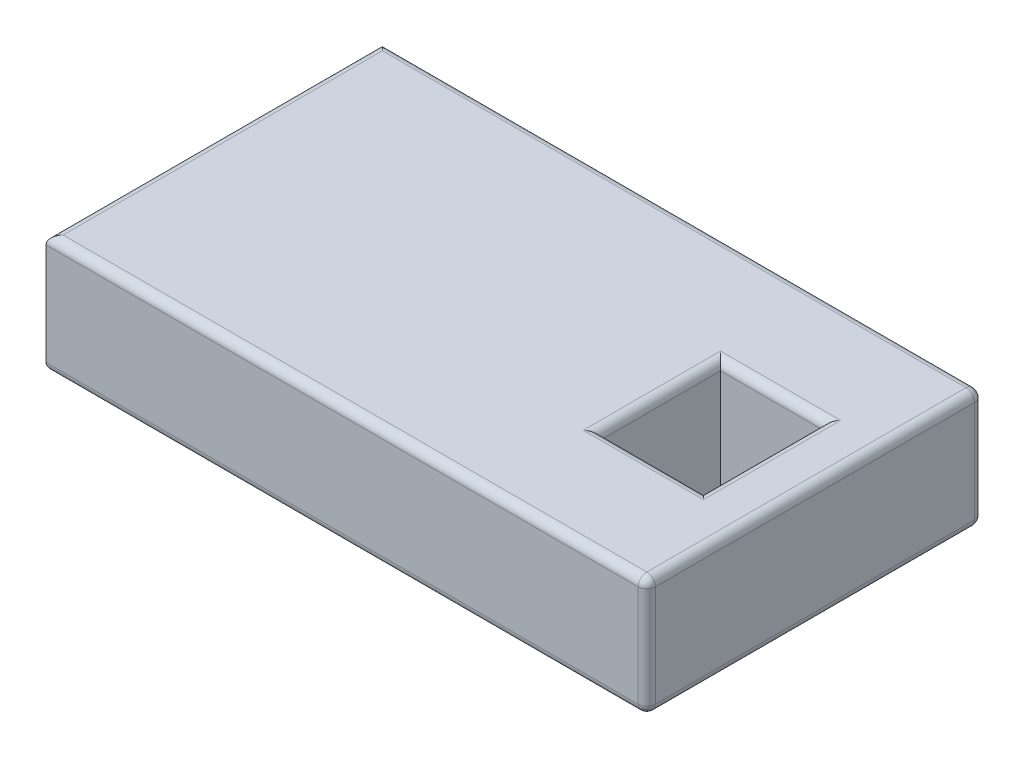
ISO-10303-21;
HEADER;
FILE_DESCRIPTION(('STEP AP214'),'2;1');
FILE_NAME('part.step','',(''),(''),'','','');
FILE_SCHEMA(('AUTOMOTIVE_DESIGN { 1 0 10303 214 1 1 1 1 }'));
ENDSEC;
DATA;
#1=APPLICATION_CONTEXT('core data for automotive mechanical design processes');
#2=APPLICATION_PROTOCOL_DEFINITION('international standard','automotive_design',2000,#1);
#3=PRODUCT_CONTEXT('',#1,'mechanical');
#4=PRODUCT('Part','Part','',(#3));
#5=PRODUCT_RELATED_PRODUCT_CATEGORY('part','',(#4));
#6=PRODUCT_DEFINITION_FORMATION('','',#4);
#7=PRODUCT_DEFINITION_CONTEXT('part definition',#1,'design');
#8=PRODUCT_DEFINITION('design','',#6,#7);
#9=PRODUCT_DEFINITION_SHAPE('','',#8);
#10=(LENGTH_UNIT() NAMED_UNIT(*) SI_UNIT(.MILLI.,.METRE.));
#11=(NAMED_UNIT(*) PLANE_ANGLE_UNIT() SI_UNIT($,.RADIAN.));
#12=(NAMED_UNIT(*) SI_UNIT($,.STERADIAN.) SOLID_ANGLE_UNIT());
#13=UNCERTAINTY_MEASURE_WITH_UNIT(LENGTH_MEASURE(1.E-05),#10,'distance_accuracy_value','');
#14=(GEOMETRIC_REPRESENTATION_CONTEXT(3) GLOBAL_UNCERTAINTY_ASSIGNED_CONTEXT((#13)) GLOBAL_UNIT_ASSIGNED_CONTEXT((#10,
#11,#12)) REPRESENTATION_CONTEXT('',''));
#15=CARTESIAN_POINT('',(0.,0.,0.));
#16=DIRECTION('',(0.,0.,1.));
#17=DIRECTION('',(1.,0.,0.));
#18=AXIS2_PLACEMENT_3D('',#15,#16,#17);
#19=CARTESIAN_POINT('',(35.,3.46,-9.795));
#20=DIRECTION('',(0.,0.,1.));
#21=DIRECTION('',(1.,0.,0.));
#22=AXIS2_PLACEMENT_3D('',#19,#20,#21);
#23=PLANE('',#22);
#24=DIRECTION('',(0.,1.,0.));
#25=VECTOR('',#24,1.);
#26=CARTESIAN_POINT('',(34.5,-3.46,-9.795));
#27=LINE('',#26,#25);
#28=CARTESIAN_POINT('',(34.5,2.96,-9.795));
#29=VERTEX_POINT('',#28);
#30=CARTESIAN_POINT('',(34.5,-2.96,-9.795));
#31=VERTEX_POINT('',#30);
#32=EDGE_CURVE('E221',#29,#31,#27,.F.);
#33=ORIENTED_EDGE('',*,*,#32,.T.);
#34=DIRECTION('',(-1.,0.,0.));
#35=VECTOR('',#34,1.);
#36=CARTESIAN_POINT('',(35.,-2.96,-9.795));
#37=LINE('',#36,#35);
#38=CARTESIAN_POINT('',(0.,-2.96,-9.795));
#39=VERTEX_POINT('',#38);
#40=EDGE_CURVE('E176',#31,#39,#37,.T.);
#41=ORIENTED_EDGE('',*,*,#40,.T.);
#42=DIRECTION('',(0.,1.,0.));
#43=VECTOR('',#42,1.);
#44=CARTESIAN_POINT('',(0.,3.46,-9.795));
#45=LINE('',#44,#43);
#46=CARTESIAN_POINT('',(0.,2.96,-9.795));
#47=VERTEX_POINT('',#46);
#48=EDGE_CURVE('E197',#39,#47,#45,.T.);
#49=ORIENTED_EDGE('',*,*,#48,.T.);
#50=DIRECTION('',(-1.,0.,0.));
#51=VECTOR('',#50,1.);
#52=CARTESIAN_POINT('',(35.,2.96,-9.795));
#53=LINE('',#52,#51);
#54=EDGE_CURVE('E219',#47,#29,#53,.F.);
#55=ORIENTED_EDGE('',*,*,#54,.T.);
#56=EDGE_LOOP('',(#33,#41,#49,#55));
#57=FACE_BOUND('',#56,.T.);
#58=ADVANCED_FACE('F34',(#57),#23,.F.);
#59=CARTESIAN_POINT('',(35.,3.46,9.795));
#60=DIRECTION('',(0.,-1.,0.));
#61=DIRECTION('',(0.,0.,-1.));
#62=AXIS2_PLACEMENT_3D('',#59,#60,#61);
#63=PLANE('',#62);
#64=DIRECTION('',(0.,0.,1.));
#65=VECTOR('',#64,1.);
#66=CARTESIAN_POINT('',(34.5,3.46,-9.795));
#67=LINE('',#66,#65);
#68=CARTESIAN_POINT('',(34.5,3.46,9.295));
#69=VERTEX_POINT('',#68);
#70=CARTESIAN_POINT('',(34.5,3.46,-9.295));
#71=VERTEX_POINT('',#70);
#72=EDGE_CURVE('E43',#69,#71,#67,.F.);
#73=ORIENTED_EDGE('',*,*,#72,.T.);
#74=DIRECTION('',(-1.,0.,0.));
#75=VECTOR('',#74,1.);
#76=CARTESIAN_POINT('',(35.,3.46,-9.295));
#77=LINE('',#76,#75);
#78=CARTESIAN_POINT('',(0.5,3.46,-9.295));
#79=VERTEX_POINT('',#78);
#80=EDGE_CURVE('E11',#71,#79,#77,.T.);
#81=ORIENTED_EDGE('',*,*,#80,.T.);
#82=DIRECTION('',(0.,0.,1.));
#83=VECTOR('',#82,1.);
#84=CARTESIAN_POINT('',(0.5,3.46,9.795));
#85=LINE('',#84,#83);
#86=CARTESIAN_POINT('',(0.5,3.46,9.295));
#87=VERTEX_POINT('',#86);
#88=EDGE_CURVE('E264',#79,#87,#85,.T.);
#89=ORIENTED_EDGE('',*,*,#88,.T.);
#90=DIRECTION('',(-1.,0.,0.));
#91=VECTOR('',#90,1.);
#92=CARTESIAN_POINT('',(35.,3.46,9.295));
#93=LINE('',#92,#91);
#94=EDGE_CURVE('E54',#87,#69,#93,.F.);
#95=ORIENTED_EDGE('',*,*,#94,.T.);
#96=EDGE_LOOP('',(#73,#81,#89,#95));
#97=FACE_BOUND('',#96,.T.);
#98=DIRECTION('',(-1.,0.,0.));
#99=VECTOR('',#98,1.);
#100=CARTESIAN_POINT('',(35.,3.46,-4.));
#101=LINE('',#100,#99);
#102=CARTESIAN_POINT('',(25.5,3.46,-4.));
#103=VERTEX_POINT('',#102);
#104=CARTESIAN_POINT('',(32.5,3.46,-4.));
#105=VERTEX_POINT('',#104);
#106=EDGE_CURVE('E259',#103,#105,#101,.F.);
#107=ORIENTED_EDGE('',*,*,#106,.T.);
#108=DIRECTION('',(0.,0.,-1.));
#109=VECTOR('',#108,1.);
#110=CARTESIAN_POINT('',(32.5,3.46,9.795));
#111=LINE('',#110,#109);
#112=CARTESIAN_POINT('',(32.5,3.46,4.));
#113=VERTEX_POINT('',#112);
#114=EDGE_CURVE('E261',#105,#113,#111,.F.);
#115=ORIENTED_EDGE('',*,*,#114,.T.);
#116=DIRECTION('',(1.,0.,0.));
#117=VECTOR('',#116,1.);
#118=CARTESIAN_POINT('',(35.,3.46,4.));
#119=LINE('',#118,#117);
#120=CARTESIAN_POINT('',(25.5,3.46,4.));
#121=VERTEX_POINT('',#120);
#122=EDGE_CURVE('E255',#113,#121,#119,.F.);
#123=ORIENTED_EDGE('',*,*,#122,.T.);
#124=DIRECTION('',(0.,0.,1.));
#125=VECTOR('',#124,1.);
#126=CARTESIAN_POINT('',(25.5,3.46,9.795));
#127=LINE('',#126,#125);
#128=EDGE_CURVE('E257',#121,#103,#127,.F.);
#129=ORIENTED_EDGE('',*,*,#128,.T.);
#130=EDGE_LOOP('',(#107,#115,#123,#129));
#131=FACE_BOUND('',#130,.T.);
#132=ADVANCED_FACE('F332',(#97,#131),#63,.F.);
#133=CARTESIAN_POINT('',(35.,3.46,9.795));
#134=DIRECTION('',(0.,0.,-1.));
#135=DIRECTION('',(0.,1.,0.));
#136=AXIS2_PLACEMENT_3D('',#133,#134,#135);
#137=PLANE('',#136);
#138=DIRECTION('',(0.,-1.,0.));
#139=VECTOR('',#138,1.);
#140=CARTESIAN_POINT('',(0.,3.46,9.795));
#141=LINE('',#140,#139);
#142=CARTESIAN_POINT('',(0.,2.96,9.795));
#143=VERTEX_POINT('',#142);
#144=CARTESIAN_POINT('',(0.,-2.96,9.795));
#145=VERTEX_POINT('',#144);
#146=EDGE_CURVE('E194',#143,#145,#141,.T.);
#147=ORIENTED_EDGE('',*,*,#146,.T.);
#148=DIRECTION('',(-1.,0.,0.));
#149=VECTOR('',#148,1.);
#150=CARTESIAN_POINT('',(35.,-2.96,9.795));
#151=LINE('',#150,#149);
#152=CARTESIAN_POINT('',(34.5,-2.96,9.795));
#153=VERTEX_POINT('',#152);
#154=EDGE_CURVE('E216',#145,#153,#151,.F.);
#155=ORIENTED_EDGE('',*,*,#154,.T.);
#156=DIRECTION('',(0.,-1.,0.));
#157=VECTOR('',#156,1.);
#158=CARTESIAN_POINT('',(34.5,3.46,9.795));
#159=LINE('',#158,#157);
#160=CARTESIAN_POINT('',(34.5,2.96,9.795));
#161=VERTEX_POINT('',#160);
#162=EDGE_CURVE('E214',#153,#161,#159,.F.);
#163=ORIENTED_EDGE('',*,*,#162,.T.);
#164=DIRECTION('',(-1.,0.,0.));
#165=VECTOR('',#164,1.);
#166=CARTESIAN_POINT('',(35.,2.96,9.795));
#167=LINE('',#166,#165);
#168=EDGE_CURVE('E212',#161,#143,#167,.T.);
#169=ORIENTED_EDGE('',*,*,#168,.T.);
#170=EDGE_LOOP('',(#147,#155,#163,#169));
#171=FACE_BOUND('',#170,.T.);
#172=ADVANCED_FACE('F408',(#171),#137,.F.);
#173=CARTESIAN_POINT('',(35.,-3.46,9.795));
#174=DIRECTION('',(0.,1.,0.));
#175=DIRECTION('',(0.,0.,1.));
#176=AXIS2_PLACEMENT_3D('',#173,#174,#175);
#177=PLANE('',#176);
#178=DIRECTION('',(1.,0.,0.));
#179=VECTOR('',#178,1.);
#180=CARTESIAN_POINT('',(35.,-3.46,4.));
#181=LINE('',#180,#179);
#182=CARTESIAN_POINT('',(25.5,-3.46,4.));
#183=VERTEX_POINT('',#182);
#184=CARTESIAN_POINT('',(32.5,-3.46,4.));
#185=VERTEX_POINT('',#184);
#186=EDGE_CURVE('E207',#183,#185,#181,.T.);
#187=ORIENTED_EDGE('',*,*,#186,.T.);
#188=DIRECTION('',(0.,0.,-1.));
#189=VECTOR('',#188,1.);
#190=CARTESIAN_POINT('',(32.5,-3.46,9.795));
#191=LINE('',#190,#189);
#192=CARTESIAN_POINT('',(32.5,-3.46,-4.));
#193=VERTEX_POINT('',#192);
#194=EDGE_CURVE('E209',#185,#193,#191,.T.);
#195=ORIENTED_EDGE('',*,*,#194,.T.);
#196=DIRECTION('',(-1.,0.,0.));
#197=VECTOR('',#196,1.);
#198=CARTESIAN_POINT('',(35.,-3.46,-4.));
#199=LINE('',#198,#197);
#200=CARTESIAN_POINT('',(25.5,-3.46,-4.));
#201=VERTEX_POINT('',#200);
#202=EDGE_CURVE('E203',#193,#201,#199,.T.);
#203=ORIENTED_EDGE('',*,*,#202,.T.);
#204=DIRECTION('',(0.,0.,1.));
#205=VECTOR('',#204,1.);
#206=CARTESIAN_POINT('',(25.5,-3.46,9.795));
#207=LINE('',#206,#205);
#208=EDGE_CURVE('E205',#201,#183,#207,.T.);
#209=ORIENTED_EDGE('',*,*,#208,.T.);
#210=EDGE_LOOP('',(#187,#195,#203,#209));
#211=FACE_BOUND('',#210,.T.);
#212=DIRECTION('',(-1.,0.,0.));
#213=VECTOR('',#212,1.);
#214=CARTESIAN_POINT('',(35.,-3.46,9.295));
#215=LINE('',#214,#213);
#216=CARTESIAN_POINT('',(34.5,-3.46,9.295));
#217=VERTEX_POINT('',#216);
#218=CARTESIAN_POINT('',(0.5,-3.46,9.295));
#219=VERTEX_POINT('',#218);
#220=EDGE_CURVE('E169',#217,#219,#215,.T.);
#221=ORIENTED_EDGE('',*,*,#220,.T.);
#222=DIRECTION('',(0.,0.,-1.));
#223=VECTOR('',#222,1.);
#224=CARTESIAN_POINT('',(0.5,-3.46,9.795));
#225=LINE('',#224,#223);
#226=CARTESIAN_POINT('',(0.5,-3.46,-9.295));
#227=VERTEX_POINT('',#226);
#228=EDGE_CURVE('E165',#219,#227,#225,.T.);
#229=ORIENTED_EDGE('',*,*,#228,.T.);
#230=DIRECTION('',(-1.,0.,0.));
#231=VECTOR('',#230,1.);
#232=CARTESIAN_POINT('',(35.,-3.46,-9.295));
#233=LINE('',#232,#231);
#234=CARTESIAN_POINT('',(34.5,-3.46,-9.295));
#235=VERTEX_POINT('',#234);
#236=EDGE_CURVE('E157',#227,#235,#233,.F.);
#237=ORIENTED_EDGE('',*,*,#236,.T.);
#238=DIRECTION('',(0.,0.,-1.));
#239=VECTOR('',#238,1.);
#240=CARTESIAN_POINT('',(34.5,-3.46,9.795));
#241=LINE('',#240,#239);
#242=EDGE_CURVE('E162',#235,#217,#241,.F.);
#243=ORIENTED_EDGE('',*,*,#242,.T.);
#244=EDGE_LOOP('',(#221,#229,#237,#243));
#245=FACE_BOUND('',#244,.T.);
#246=ADVANCED_FACE('F160',(#211,#245),#177,.F.);
#247=CARTESIAN_POINT('',(35.,0.,0.));
#248=DIRECTION('',(1.,0.,0.));
#249=DIRECTION('',(0.,0.,-1.));
#250=AXIS2_PLACEMENT_3D('',#247,#248,#249);
#251=PLANE('',#250);
#252=DIRECTION('',(0.,-1.,0.));
#253=VECTOR('',#252,1.);
#254=CARTESIAN_POINT('',(35.,-3.46,9.295));
#255=LINE('',#254,#253);
#256=CARTESIAN_POINT('',(35.,2.96,9.295));
#257=VERTEX_POINT('',#256);
#258=CARTESIAN_POINT('',(35.,-2.96,9.295));
#259=VERTEX_POINT('',#258);
#260=EDGE_CURVE('E250',#257,#259,#255,.T.);
#261=ORIENTED_EDGE('',*,*,#260,.T.);
#262=DIRECTION('',(0.,0.,-1.));
#263=VECTOR('',#262,1.);
#264=CARTESIAN_POINT('',(35.,-2.96,-9.795));
#265=LINE('',#264,#263);
#266=CARTESIAN_POINT('',(35.,-2.96,-9.295));
#267=VERTEX_POINT('',#266);
#268=EDGE_CURVE('E252',#259,#267,#265,.T.);
#269=ORIENTED_EDGE('',*,*,#268,.T.);
#270=DIRECTION('',(0.,1.,0.));
#271=VECTOR('',#270,1.);
#272=CARTESIAN_POINT('',(35.,3.46,-9.295));
#273=LINE('',#272,#271);
#274=CARTESIAN_POINT('',(35.,2.96,-9.295));
#275=VERTEX_POINT('',#274);
#276=EDGE_CURVE('E248',#267,#275,#273,.T.);
#277=ORIENTED_EDGE('',*,*,#276,.T.);
#278=DIRECTION('',(0.,0.,1.));
#279=VECTOR('',#278,1.);
#280=CARTESIAN_POINT('',(35.,2.96,9.795));
#281=LINE('',#280,#279);
#282=EDGE_CURVE('E246',#275,#257,#281,.T.);
#283=ORIENTED_EDGE('',*,*,#282,.T.);
#284=EDGE_LOOP('',(#261,#269,#277,#283));
#285=FACE_BOUND('',#284,.T.);
#286=ADVANCED_FACE('F387',(#285),#251,.T.);
#287=CARTESIAN_POINT('',(0.,0.,0.));
#288=DIRECTION('',(1.,0.,0.));
#289=DIRECTION('',(0.,0.,-1.));
#290=AXIS2_PLACEMENT_3D('',#287,#288,#289);
#291=PLANE('',#290);
#292=CARTESIAN_POINT('',(0.,0.,5.858));
#293=DIRECTION('',(-1.,0.,0.));
#294=DIRECTION('',(0.,0.,1.));
#295=AXIS2_PLACEMENT_3D('',#292,#293,#294);
#296=CIRCLE('',#295,2.16);
#297=CARTESIAN_POINT('',(0.,0.,8.018));
#298=VERTEX_POINT('',#297);
#299=EDGE_CURVE('E302',#298,#298,#296,.T.);
#300=ORIENTED_EDGE('',*,*,#299,.F.);
#301=EDGE_LOOP('',(#300));
#302=FACE_BOUND('',#301,.T.);
#303=CARTESIAN_POINT('',(0.,0.,-5.858));
#304=DIRECTION('',(-1.,0.,0.));
#305=DIRECTION('',(0.,0.,1.));
#306=AXIS2_PLACEMENT_3D('',#303,#304,#305);
#307=CIRCLE('',#306,2.16);
#308=CARTESIAN_POINT('',(0.,0.,-3.698));
#309=VERTEX_POINT('',#308);
#310=EDGE_CURVE('E729',#309,#309,#307,.T.);
#311=ORIENTED_EDGE('',*,*,#310,.F.);
#312=EDGE_LOOP('',(#311));
#313=FACE_BOUND('',#312,.T.);
#314=ORIENTED_EDGE('',*,*,#48,.F.);
#315=DIRECTION('',(0.,0.,-1.));
#316=VECTOR('',#315,1.);
#317=CARTESIAN_POINT('',(0.,-2.96,0.));
#318=LINE('',#317,#316);
#319=EDGE_CURVE('E226',#39,#145,#318,.F.);
#320=ORIENTED_EDGE('',*,*,#319,.T.);
#321=ORIENTED_EDGE('',*,*,#146,.F.);
#322=DIRECTION('',(0.,0.,1.));
#323=VECTOR('',#322,1.);
#324=CARTESIAN_POINT('',(0.,2.96,0.));
#325=LINE('',#324,#323);
#326=EDGE_CURVE('E224',#143,#47,#325,.F.);
#327=ORIENTED_EDGE('',*,*,#326,.T.);
#328=EDGE_LOOP('',(#314,#320,#321,#327));
#329=FACE_BOUND('',#328,.T.);
#330=ADVANCED_FACE('F654',(#302,#313,#329),#291,.F.);
#331=CARTESIAN_POINT('',(26.,-3.46,-3.5));
#332=DIRECTION('',(-1.,0.,0.));
#333=DIRECTION('',(0.,0.,1.));
#334=AXIS2_PLACEMENT_3D('',#331,#332,#333);
#335=PLANE('',#334);
#336=DIRECTION('',(0.,1.,0.));
#337=VECTOR('',#336,1.);
#338=CARTESIAN_POINT('',(26.,-3.46,3.5));
#339=LINE('',#338,#337);
#340=CARTESIAN_POINT('',(26.,-2.96,3.5));
#341=VERTEX_POINT('',#340);
#342=CARTESIAN_POINT('',(26.,2.96,3.5));
#343=VERTEX_POINT('',#342);
#344=EDGE_CURVE('E356',#341,#343,#339,.T.);
#345=ORIENTED_EDGE('',*,*,#344,.F.);
#346=DIRECTION('',(0.,0.,1.));
#347=VECTOR('',#346,1.);
#348=CARTESIAN_POINT('',(26.,-2.96,-3.5));
#349=LINE('',#348,#347);
#350=CARTESIAN_POINT('',(26.,-2.96,-3.5));
#351=VERTEX_POINT('',#350);
#352=EDGE_CURVE('E240',#341,#351,#349,.F.);
#353=ORIENTED_EDGE('',*,*,#352,.T.);
#354=DIRECTION('',(0.,1.,0.));
#355=VECTOR('',#354,1.);
#356=CARTESIAN_POINT('',(26.,-3.46,-3.5));
#357=LINE('',#356,#355);
#358=CARTESIAN_POINT('',(26.,2.96,-3.5));
#359=VERTEX_POINT('',#358);
#360=EDGE_CURVE('E353',#351,#359,#357,.T.);
#361=ORIENTED_EDGE('',*,*,#360,.T.);
#362=DIRECTION('',(0.,0.,1.));
#363=VECTOR('',#362,1.);
#364=CARTESIAN_POINT('',(26.,2.96,-3.5));
#365=LINE('',#364,#363);
#366=EDGE_CURVE('E238',#359,#343,#365,.T.);
#367=ORIENTED_EDGE('',*,*,#366,.T.);
#368=EDGE_LOOP('',(#345,#353,#361,#367));
#369=FACE_BOUND('',#368,.T.);
#370=ADVANCED_FACE('F646',(#369),#335,.F.);
#371=CARTESIAN_POINT('',(26.,-3.46,-3.5));
#372=DIRECTION('',(0.,0.,-1.));
#373=DIRECTION('',(-1.,0.,0.));
#374=AXIS2_PLACEMENT_3D('',#371,#372,#373);
#375=PLANE('',#374);
#376=ORIENTED_EDGE('',*,*,#360,.F.);
#377=DIRECTION('',(-1.,0.,0.));
#378=VECTOR('',#377,1.);
#379=CARTESIAN_POINT('',(26.,-2.96,-3.5));
#380=LINE('',#379,#378);
#381=CARTESIAN_POINT('',(32.,-2.96,-3.5));
#382=VERTEX_POINT('',#381);
#383=EDGE_CURVE('E244',#351,#382,#380,.F.);
#384=ORIENTED_EDGE('',*,*,#383,.T.);
#385=DIRECTION('',(0.,1.,0.));
#386=VECTOR('',#385,1.);
#387=CARTESIAN_POINT('',(32.,-3.46,-3.5));
#388=LINE('',#387,#386);
#389=CARTESIAN_POINT('',(32.,2.96,-3.5));
#390=VERTEX_POINT('',#389);
#391=EDGE_CURVE('E347',#382,#390,#388,.T.);
#392=ORIENTED_EDGE('',*,*,#391,.T.);
#393=DIRECTION('',(-1.,0.,0.));
#394=VECTOR('',#393,1.);
#395=CARTESIAN_POINT('',(26.,2.96,-3.5));
#396=LINE('',#395,#394);
#397=EDGE_CURVE('E242',#390,#359,#396,.T.);
#398=ORIENTED_EDGE('',*,*,#397,.T.);
#399=EDGE_LOOP('',(#376,#384,#392,#398));
#400=FACE_BOUND('',#399,.T.);
#401=ADVANCED_FACE('F351',(#400),#375,.F.);
#402=CARTESIAN_POINT('',(32.,-3.46,-3.5));
#403=DIRECTION('',(1.,0.,0.));
#404=DIRECTION('',(0.,0.,-1.));
#405=AXIS2_PLACEMENT_3D('',#402,#403,#404);
#406=PLANE('',#405);
#407=ORIENTED_EDGE('',*,*,#391,.F.);
#408=DIRECTION('',(0.,0.,-1.));
#409=VECTOR('',#408,1.);
#410=CARTESIAN_POINT('',(32.,-2.96,-3.5));
#411=LINE('',#410,#409);
#412=CARTESIAN_POINT('',(32.,-2.96,3.5));
#413=VERTEX_POINT('',#412);
#414=EDGE_CURVE('E231',#382,#413,#411,.F.);
#415=ORIENTED_EDGE('',*,*,#414,.T.);
#416=DIRECTION('',(0.,1.,0.));
#417=VECTOR('',#416,1.);
#418=CARTESIAN_POINT('',(32.,-3.46,3.5));
#419=LINE('',#418,#417);
#420=CARTESIAN_POINT('',(32.,2.96,3.5));
#421=VERTEX_POINT('',#420);
#422=EDGE_CURVE('E350',#413,#421,#419,.T.);
#423=ORIENTED_EDGE('',*,*,#422,.T.);
#424=DIRECTION('',(0.,0.,-1.));
#425=VECTOR('',#424,1.);
#426=CARTESIAN_POINT('',(32.,2.96,-3.5));
#427=LINE('',#426,#425);
#428=EDGE_CURVE('E228',#421,#390,#427,.T.);
#429=ORIENTED_EDGE('',*,*,#428,.T.);
#430=EDGE_LOOP('',(#407,#415,#423,#429));
#431=FACE_BOUND('',#430,.T.);
#432=ADVANCED_FACE('F346',(#431),#406,.F.);
#433=CARTESIAN_POINT('',(26.,-3.46,3.5));
#434=DIRECTION('',(0.,0.,1.));
#435=DIRECTION('',(1.,0.,0.));
#436=AXIS2_PLACEMENT_3D('',#433,#434,#435);
#437=PLANE('',#436);
#438=ORIENTED_EDGE('',*,*,#422,.F.);
#439=DIRECTION('',(1.,0.,0.));
#440=VECTOR('',#439,1.);
#441=CARTESIAN_POINT('',(26.,-2.96,3.5));
#442=LINE('',#441,#440);
#443=EDGE_CURVE('E236',#413,#341,#442,.F.);
#444=ORIENTED_EDGE('',*,*,#443,.T.);
#445=ORIENTED_EDGE('',*,*,#344,.T.);
#446=DIRECTION('',(1.,0.,0.));
#447=VECTOR('',#446,1.);
#448=CARTESIAN_POINT('',(26.,2.96,3.5));
#449=LINE('',#448,#447);
#450=EDGE_CURVE('E234',#343,#421,#449,.T.);
#451=ORIENTED_EDGE('',*,*,#450,.T.);
#452=EDGE_LOOP('',(#438,#444,#445,#451));
#453=FACE_BOUND('',#452,.T.);
#454=ADVANCED_FACE('F623',(#453),#437,.F.);
#455=CARTESIAN_POINT('',(2.,0.,-5.858));
#456=DIRECTION('',(-1.,0.,0.));
#457=DIRECTION('',(0.,0.,1.));
#458=AXIS2_PLACEMENT_3D('',#455,#456,#457);
#459=CYLINDRICAL_SURFACE('',#458,2.16);
#460=CARTESIAN_POINT('',(2.,0.,-5.858));
#461=DIRECTION('',(-1.,0.,0.));
#462=DIRECTION('',(0.,0.,1.));
#463=AXIS2_PLACEMENT_3D('',#460,#461,#462);
#464=CIRCLE('',#463,2.16);
#465=CARTESIAN_POINT('',(2.,0.,-3.698));
#466=VERTEX_POINT('',#465);
#467=EDGE_CURVE('E361',#466,#466,#464,.T.);
#468=ORIENTED_EDGE('',*,*,#467,.F.);
#469=EDGE_LOOP('',(#468));
#470=FACE_BOUND('',#469,.T.);
#471=ORIENTED_EDGE('',*,*,#310,.T.);
#472=EDGE_LOOP('',(#471));
#473=FACE_BOUND('',#472,.T.);
#474=ADVANCED_FACE('F614',(#470,#473),#459,.F.);
#475=CARTESIAN_POINT('',(2.,0.,-5.858));
#476=DIRECTION('',(-1.,0.,0.));
#477=DIRECTION('',(0.,0.,1.));
#478=AXIS2_PLACEMENT_3D('',#475,#476,#477);
#479=PLANE('',#478);
#480=ORIENTED_EDGE('',*,*,#467,.T.);
#481=EDGE_LOOP('',(#480));
#482=FACE_BOUND('',#481,.T.);
#483=ADVANCED_FACE('F605',(#482),#479,.T.);
#484=CARTESIAN_POINT('',(2.,0.,5.858));
#485=DIRECTION('',(-1.,0.,0.));
#486=DIRECTION('',(0.,0.,1.));
#487=AXIS2_PLACEMENT_3D('',#484,#485,#486);
#488=CYLINDRICAL_SURFACE('',#487,2.16);
#489=CARTESIAN_POINT('',(2.,0.,5.858));
#490=DIRECTION('',(-1.,0.,0.));
#491=DIRECTION('',(0.,0.,1.));
#492=AXIS2_PLACEMENT_3D('',#489,#490,#491);
#493=CIRCLE('',#492,2.16);
#494=CARTESIAN_POINT('',(2.,0.,8.018));
#495=VERTEX_POINT('',#494);
#496=EDGE_CURVE('E731',#495,#495,#493,.T.);
#497=ORIENTED_EDGE('',*,*,#496,.F.);
#498=EDGE_LOOP('',(#497));
#499=FACE_BOUND('',#498,.T.);
#500=ORIENTED_EDGE('',*,*,#299,.T.);
#501=EDGE_LOOP('',(#500));
#502=FACE_BOUND('',#501,.T.);
#503=ADVANCED_FACE('F596',(#499,#502),#488,.F.);
#504=CARTESIAN_POINT('',(2.,0.,5.858));
#505=DIRECTION('',(-1.,0.,0.));
#506=DIRECTION('',(0.,0.,1.));
#507=AXIS2_PLACEMENT_3D('',#504,#505,#506);
#508=PLANE('',#507);
#509=ORIENTED_EDGE('',*,*,#496,.T.);
#510=EDGE_LOOP('',(#509));
#511=FACE_BOUND('',#510,.T.);
#512=ADVANCED_FACE('F588',(#511),#508,.T.);
#513=CARTESIAN_POINT('',(35.,2.96,-9.295));
#514=DIRECTION('',(-1.,0.,0.));
#515=DIRECTION('',(0.,0.,1.));
#516=AXIS2_PLACEMENT_3D('',#513,#514,#515);
#517=CYLINDRICAL_SURFACE('',#516,0.5);
#518=CARTESIAN_POINT('',(34.5,2.96,-9.295));
#519=DIRECTION('',(1.,0.,0.));
#520=DIRECTION('',(0.,0.,-1.));
#521=AXIS2_PLACEMENT_3D('',#518,#519,#520);
#522=CIRCLE('',#521,0.5);
#523=EDGE_CURVE('E296',#29,#71,#522,.T.);
#524=ORIENTED_EDGE('',*,*,#523,.F.);
#525=ORIENTED_EDGE('',*,*,#54,.F.);
#526=CARTESIAN_POINT('',(0.5,2.96,-9.295));
#527=DIRECTION('',(-0.707106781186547,0.,0.707106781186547));
#528=DIRECTION('',(0.707106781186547,0.,0.707106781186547));
#529=AXIS2_PLACEMENT_3D('',#526,#527,#528);
#530=ELLIPSE('',#529,0.707106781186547,0.5);
#531=EDGE_CURVE('E299',#79,#47,#530,.T.);
#532=ORIENTED_EDGE('',*,*,#531,.F.);
#533=ORIENTED_EDGE('',*,*,#80,.F.);
#534=EDGE_LOOP('',(#524,#525,#532,#533));
#535=FACE_BOUND('',#534,.T.);
#536=ADVANCED_FACE('F370',(#535),#517,.T.);
#537=CARTESIAN_POINT('',(0.5,2.96,9.795));
#538=DIRECTION('',(0.,0.,1.));
#539=DIRECTION('',(1.,0.,0.));
#540=AXIS2_PLACEMENT_3D('',#537,#538,#539);
#541=CYLINDRICAL_SURFACE('',#540,0.5);
#542=ORIENTED_EDGE('',*,*,#531,.T.);
#543=ORIENTED_EDGE('',*,*,#326,.F.);
#544=CARTESIAN_POINT('',(0.5,2.96,9.295));
#545=DIRECTION('',(0.707106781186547,0.,0.707106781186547));
#546=DIRECTION('',(-0.707106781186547,0.,0.707106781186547));
#547=AXIS2_PLACEMENT_3D('',#544,#545,#546);
#548=ELLIPSE('',#547,0.707106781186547,0.5);
#549=EDGE_CURVE('E293',#87,#143,#548,.T.);
#550=ORIENTED_EDGE('',*,*,#549,.F.);
#551=ORIENTED_EDGE('',*,*,#88,.F.);
#552=EDGE_LOOP('',(#542,#543,#550,#551));
#553=FACE_BOUND('',#552,.T.);
#554=ADVANCED_FACE('F374',(#553),#541,.T.);
#555=CARTESIAN_POINT('',(34.5,2.96,-9.295));
#556=DIRECTION('',(0.,0.,1.));
#557=DIRECTION('',(1.,0.,0.));
#558=AXIS2_PLACEMENT_3D('',#555,#556,#557);
#559=SPHERICAL_SURFACE('',#558,0.5);
#560=CARTESIAN_POINT('',(34.5,2.96,-9.295));
#561=DIRECTION('',(0.,1.,0.));
#562=DIRECTION('',(0.,0.,1.));
#563=AXIS2_PLACEMENT_3D('',#560,#561,#562);
#564=CIRCLE('',#563,0.5);
#565=EDGE_CURVE('E287',#29,#275,#564,.F.);
#566=ORIENTED_EDGE('',*,*,#565,.F.);
#567=ORIENTED_EDGE('',*,*,#523,.T.);
#568=CARTESIAN_POINT('',(34.5,2.96,-9.295));
#569=DIRECTION('',(0.,0.,-1.));
#570=DIRECTION('',(-1.,0.,0.));
#571=AXIS2_PLACEMENT_3D('',#568,#569,#570);
#572=CIRCLE('',#571,0.5);
#573=EDGE_CURVE('E290',#275,#71,#572,.F.);
#574=ORIENTED_EDGE('',*,*,#573,.F.);
#575=EDGE_LOOP('',(#566,#567,#574));
#576=FACE_BOUND('',#575,.T.);
#577=ADVANCED_FACE('F378',(#576),#559,.T.);
#578=CARTESIAN_POINT('',(35.,2.96,9.295));
#579=DIRECTION('',(-1.,0.,0.));
#580=DIRECTION('',(0.,0.,1.));
#581=AXIS2_PLACEMENT_3D('',#578,#579,#580);
#582=CYLINDRICAL_SURFACE('',#581,0.5);
#583=ORIENTED_EDGE('',*,*,#549,.T.);
#584=ORIENTED_EDGE('',*,*,#168,.F.);
#585=CARTESIAN_POINT('',(34.5,2.96,9.295));
#586=DIRECTION('',(1.,0.,0.));
#587=DIRECTION('',(0.,0.,-1.));
#588=AXIS2_PLACEMENT_3D('',#585,#586,#587);
#589=CIRCLE('',#588,0.5);
#590=EDGE_CURVE('E284',#69,#161,#589,.T.);
#591=ORIENTED_EDGE('',*,*,#590,.F.);
#592=ORIENTED_EDGE('',*,*,#94,.F.);
#593=EDGE_LOOP('',(#583,#584,#591,#592));
#594=FACE_BOUND('',#593,.T.);
#595=ADVANCED_FACE('F400',(#594),#582,.T.);
#596=CARTESIAN_POINT('',(34.5,2.96,0.));
#597=DIRECTION('',(0.,0.,-1.));
#598=DIRECTION('',(-1.,0.,0.));
#599=AXIS2_PLACEMENT_3D('',#596,#597,#598);
#600=CYLINDRICAL_SURFACE('',#599,0.5);
#601=ORIENTED_EDGE('',*,*,#573,.T.);
#602=ORIENTED_EDGE('',*,*,#72,.F.);
#603=CARTESIAN_POINT('',(34.5,2.96,9.295));
#604=DIRECTION('',(0.,0.,1.));
#605=DIRECTION('',(1.,0.,0.));
#606=AXIS2_PLACEMENT_3D('',#603,#604,#605);
#607=CIRCLE('',#606,0.5);
#608=EDGE_CURVE('E281',#257,#69,#607,.T.);
#609=ORIENTED_EDGE('',*,*,#608,.F.);
#610=ORIENTED_EDGE('',*,*,#282,.F.);
#611=EDGE_LOOP('',(#601,#602,#609,#610));
#612=FACE_BOUND('',#611,.T.);
#613=ADVANCED_FACE('F382',(#612),#600,.T.);
#614=CARTESIAN_POINT('',(34.5,0.,-9.295));
#615=DIRECTION('',(0.,-1.,0.));
#616=DIRECTION('',(0.,0.,-1.));
#617=AXIS2_PLACEMENT_3D('',#614,#615,#616);
#618=CYLINDRICAL_SURFACE('',#617,0.5);
#619=ORIENTED_EDGE('',*,*,#565,.T.);
#620=ORIENTED_EDGE('',*,*,#276,.F.);
#621=CARTESIAN_POINT('',(34.5,-2.96,-9.295));
#622=DIRECTION('',(0.,-1.,0.));
#623=DIRECTION('',(1.,0.,0.));
#624=AXIS2_PLACEMENT_3D('',#621,#622,#623);
#625=CIRCLE('',#624,0.5);
#626=EDGE_CURVE('E184',#31,#267,#625,.T.);
#627=ORIENTED_EDGE('',*,*,#626,.F.);
#628=ORIENTED_EDGE('',*,*,#32,.F.);
#629=EDGE_LOOP('',(#619,#620,#627,#628));
#630=FACE_BOUND('',#629,.T.);
#631=ADVANCED_FACE('F390',(#630),#618,.T.);
#632=CARTESIAN_POINT('',(34.5,2.96,9.295));
#633=DIRECTION('',(0.,0.,1.));
#634=DIRECTION('',(1.,0.,0.));
#635=AXIS2_PLACEMENT_3D('',#632,#633,#634);
#636=SPHERICAL_SURFACE('',#635,0.5);
#637=ORIENTED_EDGE('',*,*,#608,.T.);
#638=ORIENTED_EDGE('',*,*,#590,.T.);
#639=CARTESIAN_POINT('',(34.5,2.96,9.295));
#640=DIRECTION('',(0.,1.,0.));
#641=DIRECTION('',(0.,0.,1.));
#642=AXIS2_PLACEMENT_3D('',#639,#640,#641);
#643=CIRCLE('',#642,0.5);
#644=EDGE_CURVE('E188',#257,#161,#643,.F.);
#645=ORIENTED_EDGE('',*,*,#644,.F.);
#646=EDGE_LOOP('',(#637,#638,#645));
#647=FACE_BOUND('',#646,.T.);
#648=ADVANCED_FACE('F392',(#647),#636,.T.);
#649=CARTESIAN_POINT('',(34.5,-2.96,-9.295));
#650=DIRECTION('',(0.,0.,1.));
#651=DIRECTION('',(1.,0.,0.));
#652=AXIS2_PLACEMENT_3D('',#649,#650,#651);
#653=SPHERICAL_SURFACE('',#652,0.5);
#654=CARTESIAN_POINT('',(34.5,-2.96,-9.295));
#655=DIRECTION('',(1.,0.,0.));
#656=DIRECTION('',(0.,0.,-1.));
#657=AXIS2_PLACEMENT_3D('',#654,#655,#656);
#658=CIRCLE('',#657,0.5);
#659=EDGE_CURVE('E173',#31,#235,#658,.F.);
#660=ORIENTED_EDGE('',*,*,#659,.F.);
#661=ORIENTED_EDGE('',*,*,#626,.T.);
#662=CARTESIAN_POINT('',(34.5,-2.96,-9.295));
#663=DIRECTION('',(0.,0.,-1.));
#664=DIRECTION('',(-1.,0.,0.));
#665=AXIS2_PLACEMENT_3D('',#662,#663,#664);
#666=CIRCLE('',#665,0.5);
#667=EDGE_CURVE('E179',#235,#267,#666,.F.);
#668=ORIENTED_EDGE('',*,*,#667,.F.);
#669=EDGE_LOOP('',(#660,#661,#668));
#670=FACE_BOUND('',#669,.T.);
#671=ADVANCED_FACE('F182',(#670),#653,.T.);
#672=CARTESIAN_POINT('',(34.5,0.,9.295));
#673=DIRECTION('',(0.,1.,0.));
#674=DIRECTION('',(0.,0.,1.));
#675=AXIS2_PLACEMENT_3D('',#672,#673,#674);
#676=CYLINDRICAL_SURFACE('',#675,0.5);
#677=ORIENTED_EDGE('',*,*,#644,.T.);
#678=ORIENTED_EDGE('',*,*,#162,.F.);
#679=CARTESIAN_POINT('',(34.5,-2.96,9.295));
#680=DIRECTION('',(0.,-1.,0.));
#681=DIRECTION('',(0.,0.,-1.));
#682=AXIS2_PLACEMENT_3D('',#679,#680,#681);
#683=CIRCLE('',#682,0.5);
#684=EDGE_CURVE('E180',#259,#153,#683,.T.);
#685=ORIENTED_EDGE('',*,*,#684,.F.);
#686=ORIENTED_EDGE('',*,*,#260,.F.);
#687=EDGE_LOOP('',(#677,#678,#685,#686));
#688=FACE_BOUND('',#687,.T.);
#689=ADVANCED_FACE('F429',(#688),#676,.T.);
#690=CARTESIAN_POINT('',(34.5,-2.96,0.));
#691=DIRECTION('',(0.,0.,1.));
#692=DIRECTION('',(1.,0.,0.));
#693=AXIS2_PLACEMENT_3D('',#690,#691,#692);
#694=CYLINDRICAL_SURFACE('',#693,0.5);
#695=ORIENTED_EDGE('',*,*,#667,.T.);
#696=ORIENTED_EDGE('',*,*,#268,.F.);
#697=CARTESIAN_POINT('',(34.5,-2.96,9.295));
#698=DIRECTION('',(0.,0.,1.));
#699=DIRECTION('',(1.,0.,0.));
#700=AXIS2_PLACEMENT_3D('',#697,#698,#699);
#701=CIRCLE('',#700,0.5);
#702=EDGE_CURVE('E192',#217,#259,#701,.T.);
#703=ORIENTED_EDGE('',*,*,#702,.F.);
#704=ORIENTED_EDGE('',*,*,#242,.F.);
#705=EDGE_LOOP('',(#695,#696,#703,#704));
#706=FACE_BOUND('',#705,.T.);
#707=ADVANCED_FACE('F190',(#706),#694,.T.);
#708=CARTESIAN_POINT('',(35.,-2.96,-9.295));
#709=DIRECTION('',(-1.,0.,0.));
#710=DIRECTION('',(0.,0.,1.));
#711=AXIS2_PLACEMENT_3D('',#708,#709,#710);
#712=CYLINDRICAL_SURFACE('',#711,0.5);
#713=ORIENTED_EDGE('',*,*,#659,.T.);
#714=ORIENTED_EDGE('',*,*,#236,.F.);
#715=CARTESIAN_POINT('',(0.5,-2.96,-9.295));
#716=DIRECTION('',(0.707106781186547,0.,-0.707106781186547));
#717=DIRECTION('',(-0.707106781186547,0.,-0.707106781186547));
#718=AXIS2_PLACEMENT_3D('',#715,#716,#717);
#719=ELLIPSE('',#718,0.707106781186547,0.5);
#720=EDGE_CURVE('E273',#39,#227,#719,.F.);
#721=ORIENTED_EDGE('',*,*,#720,.F.);
#722=ORIENTED_EDGE('',*,*,#40,.F.);
#723=EDGE_LOOP('',(#713,#714,#721,#722));
#724=FACE_BOUND('',#723,.T.);
#725=ADVANCED_FACE('F175',(#724),#712,.T.);
#726=CARTESIAN_POINT('',(34.5,-2.96,9.295));
#727=DIRECTION('',(0.,0.,1.));
#728=DIRECTION('',(1.,0.,0.));
#729=AXIS2_PLACEMENT_3D('',#726,#727,#728);
#730=SPHERICAL_SURFACE('',#729,0.5);
#731=ORIENTED_EDGE('',*,*,#702,.T.);
#732=ORIENTED_EDGE('',*,*,#684,.T.);
#733=CARTESIAN_POINT('',(34.5,-2.96,9.295));
#734=DIRECTION('',(1.,0.,0.));
#735=DIRECTION('',(0.,0.,-1.));
#736=AXIS2_PLACEMENT_3D('',#733,#734,#735);
#737=CIRCLE('',#736,0.5);
#738=EDGE_CURVE('E270',#217,#153,#737,.F.);
#739=ORIENTED_EDGE('',*,*,#738,.F.);
#740=EDGE_LOOP('',(#731,#732,#739));
#741=FACE_BOUND('',#740,.T.);
#742=ADVANCED_FACE('F420',(#741),#730,.T.);
#743=CARTESIAN_POINT('',(0.5,-2.96,9.795));
#744=DIRECTION('',(0.,0.,-1.));
#745=DIRECTION('',(-1.,0.,0.));
#746=AXIS2_PLACEMENT_3D('',#743,#744,#745);
#747=CYLINDRICAL_SURFACE('',#746,0.5);
#748=ORIENTED_EDGE('',*,*,#720,.T.);
#749=ORIENTED_EDGE('',*,*,#228,.F.);
#750=CARTESIAN_POINT('',(0.5,-2.96,9.295));
#751=DIRECTION('',(-0.707106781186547,0.,-0.707106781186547));
#752=DIRECTION('',(0.707106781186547,0.,-0.707106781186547));
#753=AXIS2_PLACEMENT_3D('',#750,#751,#752);
#754=ELLIPSE('',#753,0.707106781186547,0.5);
#755=EDGE_CURVE('E268',#145,#219,#754,.F.);
#756=ORIENTED_EDGE('',*,*,#755,.F.);
#757=ORIENTED_EDGE('',*,*,#319,.F.);
#758=EDGE_LOOP('',(#748,#749,#756,#757));
#759=FACE_BOUND('',#758,.T.);
#760=ADVANCED_FACE('F416',(#759),#747,.T.);
#761=CARTESIAN_POINT('',(35.,-2.96,9.295));
#762=DIRECTION('',(-1.,0.,0.));
#763=DIRECTION('',(0.,0.,1.));
#764=AXIS2_PLACEMENT_3D('',#761,#762,#763);
#765=CYLINDRICAL_SURFACE('',#764,0.5);
#766=ORIENTED_EDGE('',*,*,#738,.T.);
#767=ORIENTED_EDGE('',*,*,#154,.F.);
#768=ORIENTED_EDGE('',*,*,#755,.T.);
#769=ORIENTED_EDGE('',*,*,#220,.F.);
#770=EDGE_LOOP('',(#766,#767,#768,#769));
#771=FACE_BOUND('',#770,.T.);
#772=ADVANCED_FACE('F412',(#771),#765,.T.);
#773=CARTESIAN_POINT('',(25.5,-2.96,9.795));
#774=DIRECTION('',(0.,0.,1.));
#775=DIRECTION('',(1.,0.,0.));
#776=AXIS2_PLACEMENT_3D('',#773,#774,#775);
#777=CYLINDRICAL_SURFACE('',#776,0.5);
#778=CARTESIAN_POINT('',(25.5,-2.96,-4.));
#779=DIRECTION('',(-0.707106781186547,0.,0.707106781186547));
#780=DIRECTION('',(0.707106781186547,0.,0.707106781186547));
#781=AXIS2_PLACEMENT_3D('',#778,#779,#780);
#782=ELLIPSE('',#781,0.707106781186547,0.5);
#783=EDGE_CURVE('E307',#351,#201,#782,.F.);
#784=ORIENTED_EDGE('',*,*,#783,.F.);
#785=ORIENTED_EDGE('',*,*,#352,.F.);
#786=CARTESIAN_POINT('',(25.5,-2.96,4.));
#787=DIRECTION('',(0.707106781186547,0.,0.707106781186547));
#788=DIRECTION('',(0.707106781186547,0.,-0.707106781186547));
#789=AXIS2_PLACEMENT_3D('',#786,#787,#788);
#790=ELLIPSE('',#789,0.707106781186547,0.5);
#791=EDGE_CURVE('E271',#183,#341,#790,.T.);
#792=ORIENTED_EDGE('',*,*,#791,.F.);
#793=ORIENTED_EDGE('',*,*,#208,.F.);
#794=EDGE_LOOP('',(#784,#785,#792,#793));
#795=FACE_BOUND('',#794,.T.);
#796=ADVANCED_FACE('F415',(#795),#777,.T.);
#797=CARTESIAN_POINT('',(35.,-2.96,4.));
#798=DIRECTION('',(1.,0.,0.));
#799=DIRECTION('',(0.,0.,-1.));
#800=AXIS2_PLACEMENT_3D('',#797,#798,#799);
#801=CYLINDRICAL_SURFACE('',#800,0.5);
#802=ORIENTED_EDGE('',*,*,#791,.T.);
#803=ORIENTED_EDGE('',*,*,#443,.F.);
#804=CARTESIAN_POINT('',(32.5,-2.96,4.));
#805=DIRECTION('',(0.707106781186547,0.,-0.707106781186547));
#806=DIRECTION('',(-0.707106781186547,0.,-0.707106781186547));
#807=AXIS2_PLACEMENT_3D('',#804,#805,#806);
#808=ELLIPSE('',#807,0.707106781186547,0.5);
#809=EDGE_CURVE('E305',#185,#413,#808,.T.);
#810=ORIENTED_EDGE('',*,*,#809,.F.);
#811=ORIENTED_EDGE('',*,*,#186,.F.);
#812=EDGE_LOOP('',(#802,#803,#810,#811));
#813=FACE_BOUND('',#812,.T.);
#814=ADVANCED_FACE('F468',(#813),#801,.T.);
#815=CARTESIAN_POINT('',(35.,-2.96,-4.));
#816=DIRECTION('',(-1.,0.,0.));
#817=DIRECTION('',(0.,0.,1.));
#818=AXIS2_PLACEMENT_3D('',#815,#816,#817);
#819=CYLINDRICAL_SURFACE('',#818,0.5);
#820=ORIENTED_EDGE('',*,*,#783,.T.);
#821=ORIENTED_EDGE('',*,*,#202,.F.);
#822=CARTESIAN_POINT('',(32.5,-2.96,-4.));
#823=DIRECTION('',(-0.707106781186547,0.,-0.707106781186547));
#824=DIRECTION('',(0.707106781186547,0.,-0.707106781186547));
#825=AXIS2_PLACEMENT_3D('',#822,#823,#824);
#826=ELLIPSE('',#825,0.707106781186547,0.5);
#827=EDGE_CURVE('E303',#382,#193,#826,.F.);
#828=ORIENTED_EDGE('',*,*,#827,.F.);
#829=ORIENTED_EDGE('',*,*,#383,.F.);
#830=EDGE_LOOP('',(#820,#821,#828,#829));
#831=FACE_BOUND('',#830,.T.);
#832=ADVANCED_FACE('F476',(#831),#819,.T.);
#833=CARTESIAN_POINT('',(32.5,-2.96,9.795));
#834=DIRECTION('',(0.,0.,-1.));
#835=DIRECTION('',(-1.,0.,0.));
#836=AXIS2_PLACEMENT_3D('',#833,#834,#835);
#837=CYLINDRICAL_SURFACE('',#836,0.5);
#838=ORIENTED_EDGE('',*,*,#809,.T.);
#839=ORIENTED_EDGE('',*,*,#414,.F.);
#840=ORIENTED_EDGE('',*,*,#827,.T.);
#841=ORIENTED_EDGE('',*,*,#194,.F.);
#842=EDGE_LOOP('',(#838,#839,#840,#841));
#843=FACE_BOUND('',#842,.T.);
#844=ADVANCED_FACE('F484',(#843),#837,.T.);
#845=CARTESIAN_POINT('',(25.5,2.96,-3.5));
#846=DIRECTION('',(0.,0.,1.));
#847=DIRECTION('',(1.,0.,0.));
#848=AXIS2_PLACEMENT_3D('',#845,#846,#847);
#849=CYLINDRICAL_SURFACE('',#848,0.5);
#850=CARTESIAN_POINT('',(25.5,2.96,-4.));
#851=DIRECTION('',(-0.707106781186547,0.,0.707106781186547));
#852=DIRECTION('',(-0.707106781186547,0.,-0.707106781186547));
#853=AXIS2_PLACEMENT_3D('',#850,#851,#852);
#854=ELLIPSE('',#853,0.707106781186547,0.5);
#855=EDGE_CURVE('E315',#103,#359,#854,.F.);
#856=ORIENTED_EDGE('',*,*,#855,.F.);
#857=ORIENTED_EDGE('',*,*,#128,.F.);
#858=CARTESIAN_POINT('',(25.5,2.96,4.));
#859=DIRECTION('',(0.707106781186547,0.,0.707106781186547));
#860=DIRECTION('',(-0.707106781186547,0.,0.707106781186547));
#861=AXIS2_PLACEMENT_3D('',#858,#859,#860);
#862=ELLIPSE('',#861,0.707106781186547,0.5);
#863=EDGE_CURVE('E38',#343,#121,#862,.T.);
#864=ORIENTED_EDGE('',*,*,#863,.F.);
#865=ORIENTED_EDGE('',*,*,#366,.F.);
#866=EDGE_LOOP('',(#856,#857,#864,#865));
#867=FACE_BOUND('',#866,.T.);
#868=ADVANCED_FACE('F36',(#867),#849,.T.);
#869=CARTESIAN_POINT('',(26.,2.96,4.));
#870=DIRECTION('',(1.,0.,0.));
#871=DIRECTION('',(0.,0.,-1.));
#872=AXIS2_PLACEMENT_3D('',#869,#870,#871);
#873=CYLINDRICAL_SURFACE('',#872,0.5);
#874=ORIENTED_EDGE('',*,*,#863,.T.);
#875=ORIENTED_EDGE('',*,*,#122,.F.);
#876=CARTESIAN_POINT('',(32.5,2.96,4.));
#877=DIRECTION('',(0.707106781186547,0.,-0.707106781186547));
#878=DIRECTION('',(-0.707106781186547,0.,-0.707106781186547));
#879=AXIS2_PLACEMENT_3D('',#876,#877,#878);
#880=ELLIPSE('',#879,0.707106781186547,0.5);
#881=EDGE_CURVE('E314',#421,#113,#880,.T.);
#882=ORIENTED_EDGE('',*,*,#881,.F.);
#883=ORIENTED_EDGE('',*,*,#450,.F.);
#884=EDGE_LOOP('',(#874,#875,#882,#883));
#885=FACE_BOUND('',#884,.T.);
#886=ADVANCED_FACE('F326',(#885),#873,.T.);
#887=CARTESIAN_POINT('',(26.,2.96,-4.));
#888=DIRECTION('',(-1.,0.,0.));
#889=DIRECTION('',(0.,0.,1.));
#890=AXIS2_PLACEMENT_3D('',#887,#888,#889);
#891=CYLINDRICAL_SURFACE('',#890,0.5);
#892=ORIENTED_EDGE('',*,*,#855,.T.);
#893=ORIENTED_EDGE('',*,*,#397,.F.);
#894=CARTESIAN_POINT('',(32.5,2.96,-4.));
#895=DIRECTION('',(-0.707106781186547,0.,-0.707106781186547));
#896=DIRECTION('',(0.707106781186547,0.,-0.707106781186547));
#897=AXIS2_PLACEMENT_3D('',#894,#895,#896);
#898=ELLIPSE('',#897,0.707106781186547,0.5);
#899=EDGE_CURVE('E312',#105,#390,#898,.F.);
#900=ORIENTED_EDGE('',*,*,#899,.F.);
#901=ORIENTED_EDGE('',*,*,#106,.F.);
#902=EDGE_LOOP('',(#892,#893,#900,#901));
#903=FACE_BOUND('',#902,.T.);
#904=ADVANCED_FACE('F338',(#903),#891,.T.);
#905=CARTESIAN_POINT('',(32.5,2.96,-3.5));
#906=DIRECTION('',(0.,0.,-1.));
#907=DIRECTION('',(-1.,0.,0.));
#908=AXIS2_PLACEMENT_3D('',#905,#906,#907);
#909=CYLINDRICAL_SURFACE('',#908,0.5);
#910=ORIENTED_EDGE('',*,*,#881,.T.);
#911=ORIENTED_EDGE('',*,*,#114,.F.);
#912=ORIENTED_EDGE('',*,*,#899,.T.);
#913=ORIENTED_EDGE('',*,*,#428,.F.);
#914=EDGE_LOOP('',(#910,#911,#912,#913));
#915=FACE_BOUND('',#914,.T.);
#916=ADVANCED_FACE('F336',(#915),#909,.T.);
#917=CLOSED_SHELL('',(#58,#132,#172,#246,#286,#330,#370,#401,#432,#454,#474,#483,#503,#512,#536,
#554,#577,#595,#613,#631,#648,#671,#689,#707,#725,#742,#760,#772,#796,#814,#832,#844,#868,#886,
#904,#916));
#918=MANIFOLD_SOLID_BREP('B2',#917);
#919=ADVANCED_BREP_SHAPE_REPRESENTATION('',(#18,#918),#14);
#920=SHAPE_DEFINITION_REPRESENTATION(#9,#919);
ENDSEC;
END-ISO-10303-21;
